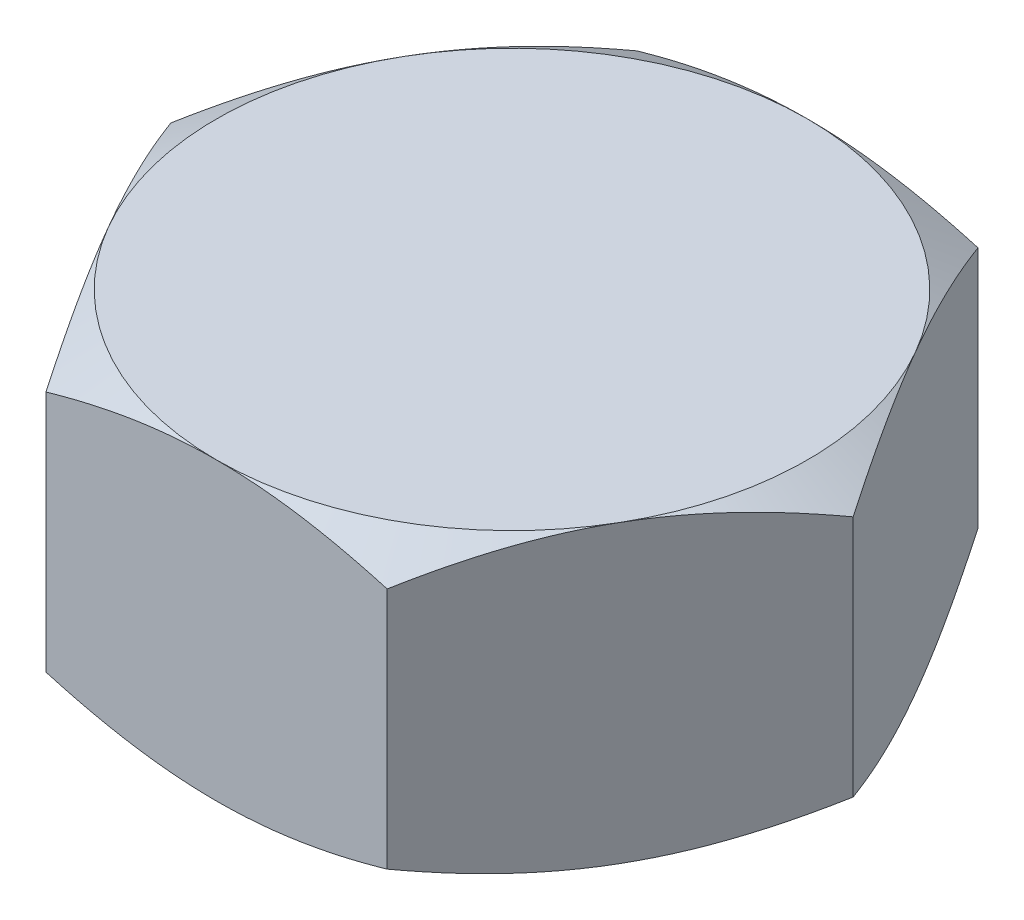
from build123d import *

# Parameters (mm, degrees)
EXTRUSION1_DEPTH = 2.5


with BuildPart() as part:
    # Esquisse1 → Extrusion1 (new, symmetric)
    with BuildSketch(Plane(origin=(0, 0, 0), x_dir=(1, 0, 0), z_dir=(0, 1, 0))):
        Polygon((5.773502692, 0), (2.886751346, 5), (-2.886751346, 5), (-5.773502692, 0), (-2.886751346, -5), (2.886751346, -5), align=None)
    extrude(amount=EXTRUSION1_DEPTH, both=True)

    # Esquisse2 → Enl_vement de mati_re-R_volution4 (revolve, cut)
    with BuildSketch(Plane(origin=(0, 0, 0), x_dir=(0, 0, -1), z_dir=(1, 0, 0))):
        Polygon((2, 4.232050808), (8, 4.232050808), (8, 0.767949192), align=None)
    enl_vement_de_mati_re_r_volution4 = revolve(axis=Axis((0, 9.378046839, 0), (0, -1, 0)), mode=Mode.SUBTRACT)

    # Sym_trie1: Enl_vement de mati_re-R_volution4 across plane
    add(enl_vement_de_mati_re_r_volution4.mirror(Plane.ZX), mode=Mode.SUBTRACT)


solid = part.part
